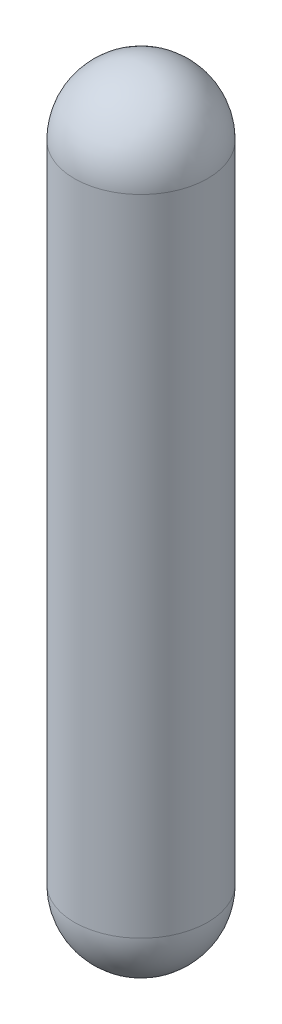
ISO-10303-21;
HEADER;
FILE_DESCRIPTION(('STEP AP214'),'2;1');
FILE_NAME('part.step','',(''),(''),'','','');
FILE_SCHEMA(('AUTOMOTIVE_DESIGN { 1 0 10303 214 1 1 1 1 }'));
ENDSEC;
DATA;
#1=APPLICATION_CONTEXT('core data for automotive mechanical design processes');
#2=APPLICATION_PROTOCOL_DEFINITION('international standard','automotive_design',2000,#1);
#3=PRODUCT_CONTEXT('',#1,'mechanical');
#4=PRODUCT('Part','Part','',(#3));
#5=PRODUCT_RELATED_PRODUCT_CATEGORY('part','',(#4));
#6=PRODUCT_DEFINITION_FORMATION('','',#4);
#7=PRODUCT_DEFINITION_CONTEXT('part definition',#1,'design');
#8=PRODUCT_DEFINITION('design','',#6,#7);
#9=PRODUCT_DEFINITION_SHAPE('','',#8);
#10=(LENGTH_UNIT() NAMED_UNIT(*) SI_UNIT(.MILLI.,.METRE.));
#11=(NAMED_UNIT(*) PLANE_ANGLE_UNIT() SI_UNIT($,.RADIAN.));
#12=(NAMED_UNIT(*) SI_UNIT($,.STERADIAN.) SOLID_ANGLE_UNIT());
#13=UNCERTAINTY_MEASURE_WITH_UNIT(LENGTH_MEASURE(1.E-05),#10,'distance_accuracy_value','');
#14=(GEOMETRIC_REPRESENTATION_CONTEXT(3) GLOBAL_UNCERTAINTY_ASSIGNED_CONTEXT((#13)) GLOBAL_UNIT_ASSIGNED_CONTEXT((#10,
#11,#12)) REPRESENTATION_CONTEXT('',''));
#15=CARTESIAN_POINT('',(0.,0.,0.));
#16=DIRECTION('',(0.,0.,1.));
#17=DIRECTION('',(1.,0.,0.));
#18=AXIS2_PLACEMENT_3D('',#15,#16,#17);
#19=CARTESIAN_POINT('',(90.45,-94.5,0.));
#20=DIRECTION('',(0.,1.,0.));
#21=DIRECTION('',(0.,0.,-1.));
#22=AXIS2_PLACEMENT_3D('',#19,#20,#21);
#23=CYLINDRICAL_SURFACE('',#22,1.5);
#24=CARTESIAN_POINT('',(90.45,-80.,0.));
#25=DIRECTION('',(0.,-1.,0.));
#26=DIRECTION('',(1.,0.,0.));
#27=AXIS2_PLACEMENT_3D('',#24,#25,#26);
#28=CIRCLE('',#27,1.5);
#29=CARTESIAN_POINT('',(90.45,-80.,-1.5));
#30=VERTEX_POINT('',#29);
#31=CARTESIAN_POINT('',(90.45,-80.,1.5));
#32=VERTEX_POINT('',#31);
#33=EDGE_CURVE('E11',#30,#32,#28,.T.);
#34=ORIENTED_EDGE('',*,*,#33,.T.);
#35=CARTESIAN_POINT('',(90.45,-80.,0.));
#36=DIRECTION('',(0.,1.,0.));
#37=DIRECTION('',(-1.,0.,0.));
#38=AXIS2_PLACEMENT_3D('',#35,#36,#37);
#39=CIRCLE('',#38,1.5);
#40=EDGE_CURVE('E24',#30,#32,#39,.T.);
#41=ORIENTED_EDGE('',*,*,#40,.F.);
#42=EDGE_LOOP('',(#34,#41));
#43=FACE_BOUND('',#42,.T.);
#44=CARTESIAN_POINT('',(90.45,-94.5,0.));
#45=DIRECTION('',(0.,-1.,0.));
#46=DIRECTION('',(1.,0.,0.));
#47=AXIS2_PLACEMENT_3D('',#44,#45,#46);
#48=CIRCLE('',#47,1.5);
#49=CARTESIAN_POINT('',(90.45,-94.5,-1.5));
#50=VERTEX_POINT('',#49);
#51=CARTESIAN_POINT('',(90.45,-94.5,1.5));
#52=VERTEX_POINT('',#51);
#53=EDGE_CURVE('E40',#50,#52,#48,.T.);
#54=ORIENTED_EDGE('',*,*,#53,.F.);
#55=CARTESIAN_POINT('',(90.45,-94.5,0.));
#56=DIRECTION('',(0.,1.,0.));
#57=DIRECTION('',(-1.,0.,0.));
#58=AXIS2_PLACEMENT_3D('',#55,#56,#57);
#59=CIRCLE('',#58,1.5);
#60=EDGE_CURVE('E30',#50,#52,#59,.T.);
#61=ORIENTED_EDGE('',*,*,#60,.T.);
#62=EDGE_LOOP('',(#54,#61));
#63=FACE_BOUND('',#62,.T.);
#64=ADVANCED_FACE('F16',(#43,#63),#23,.T.);
#65=CARTESIAN_POINT('',(90.45,-80.,0.));
#66=DIRECTION('',(0.,0.,1.));
#67=DIRECTION('',(1.,0.,0.));
#68=AXIS2_PLACEMENT_3D('',#65,#66,#67);
#69=SPHERICAL_SURFACE('',#68,1.5);
#70=CARTESIAN_POINT('',(90.45,-80.,0.));
#71=DIRECTION('',(0.,-1.,0.));
#72=DIRECTION('',(1.,0.,0.));
#73=AXIS2_PLACEMENT_3D('',#70,#71,#72);
#74=SPHERICAL_SURFACE('',#73,1.5);
#75=ORIENTED_EDGE('',*,*,#33,.F.);
#76=ORIENTED_EDGE('',*,*,#40,.T.);
#77=EDGE_LOOP('',(#75,#76));
#78=FACE_BOUND('',#77,.T.);
#79=ADVANCED_FACE('F62',(#78),#74,.T.);
#80=CARTESIAN_POINT('',(90.45,-94.5,0.));
#81=DIRECTION('',(0.,0.,1.));
#82=DIRECTION('',(-1.,0.,0.));
#83=AXIS2_PLACEMENT_3D('',#80,#81,#82);
#84=SPHERICAL_SURFACE('',#83,1.5);
#85=CARTESIAN_POINT('',(90.45,-94.5,0.));
#86=DIRECTION('',(0.,1.,0.));
#87=DIRECTION('',(-1.,0.,0.));
#88=AXIS2_PLACEMENT_3D('',#85,#86,#87);
#89=SPHERICAL_SURFACE('',#88,1.5);
#90=ORIENTED_EDGE('',*,*,#60,.F.);
#91=ORIENTED_EDGE('',*,*,#53,.T.);
#92=EDGE_LOOP('',(#90,#91));
#93=FACE_BOUND('',#92,.T.);
#94=ADVANCED_FACE('F41',(#93),#89,.T.);
#95=CLOSED_SHELL('',(#64,#79,#94));
#96=MANIFOLD_SOLID_BREP('B1',#95);
#97=ADVANCED_BREP_SHAPE_REPRESENTATION('',(#18,#96),#14);
#98=SHAPE_DEFINITION_REPRESENTATION(#9,#97);
ENDSEC;
END-ISO-10303-21;
